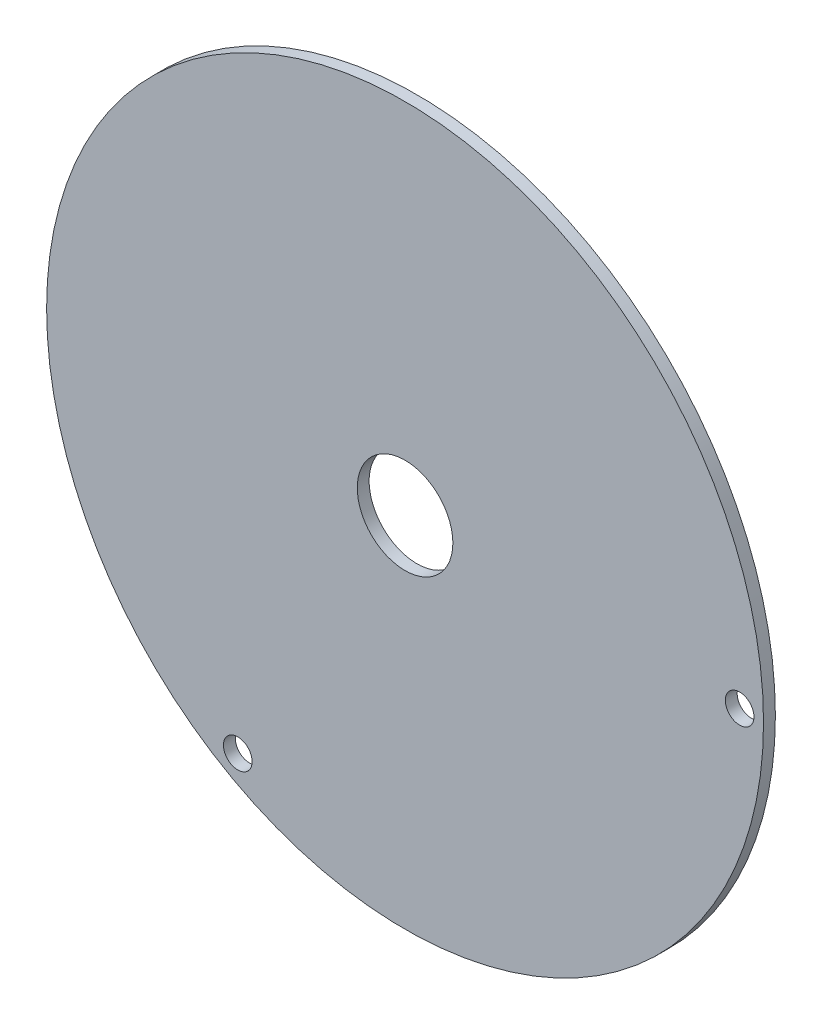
ISO-10303-21;
HEADER;
FILE_DESCRIPTION(('STEP AP214'),'2;1');
FILE_NAME('part.step','',(''),(''),'','','');
FILE_SCHEMA(('AUTOMOTIVE_DESIGN { 1 0 10303 214 1 1 1 1 }'));
ENDSEC;
DATA;
#1=APPLICATION_CONTEXT('core data for automotive mechanical design processes');
#2=APPLICATION_PROTOCOL_DEFINITION('international standard','automotive_design',2000,#1);
#3=PRODUCT_CONTEXT('',#1,'mechanical');
#4=PRODUCT('Part','Part','',(#3));
#5=PRODUCT_RELATED_PRODUCT_CATEGORY('part','',(#4));
#6=PRODUCT_DEFINITION_FORMATION('','',#4);
#7=PRODUCT_DEFINITION_CONTEXT('part definition',#1,'design');
#8=PRODUCT_DEFINITION('design','',#6,#7);
#9=PRODUCT_DEFINITION_SHAPE('','',#8);
#10=(LENGTH_UNIT() NAMED_UNIT(*) SI_UNIT(.MILLI.,.METRE.));
#11=(NAMED_UNIT(*) PLANE_ANGLE_UNIT() SI_UNIT($,.RADIAN.));
#12=(NAMED_UNIT(*) SI_UNIT($,.STERADIAN.) SOLID_ANGLE_UNIT());
#13=UNCERTAINTY_MEASURE_WITH_UNIT(LENGTH_MEASURE(1.E-05),#10,'distance_accuracy_value','');
#14=(GEOMETRIC_REPRESENTATION_CONTEXT(3) GLOBAL_UNCERTAINTY_ASSIGNED_CONTEXT((#13)) GLOBAL_UNIT_ASSIGNED_CONTEXT((#10,
#11,#12)) REPRESENTATION_CONTEXT('',''));
#15=CARTESIAN_POINT('',(0.,0.,0.));
#16=DIRECTION('',(0.,0.,1.));
#17=DIRECTION('',(1.,0.,0.));
#18=AXIS2_PLACEMENT_3D('',#15,#16,#17);
#19=CARTESIAN_POINT('',(0.,0.,1.57480000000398));
#20=DIRECTION('',(0.,0.,-1.));
#21=DIRECTION('',(-0.999999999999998,0.,0.));
#22=AXIS2_PLACEMENT_3D('',#19,#20,#21);
#23=CYLINDRICAL_SURFACE('',#22,47.625);
#24=CARTESIAN_POINT('',(0.,0.,1.57480000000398));
#25=DIRECTION('',(0.,0.,1.));
#26=DIRECTION('',(0.999999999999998,0.,0.));
#27=AXIS2_PLACEMENT_3D('',#24,#25,#26);
#28=CIRCLE('',#27,47.625);
#29=CARTESIAN_POINT('',(47.6249999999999,-1.20445320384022E-13,1.57480000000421));
#30=VERTEX_POINT('',#29);
#31=EDGE_CURVE('E10',#30,#30,#28,.T.);
#32=ORIENTED_EDGE('',*,*,#31,.F.);
#33=EDGE_LOOP('',(#32));
#34=FACE_BOUND('',#33,.T.);
#35=CARTESIAN_POINT('',(0.,0.,0.));
#36=DIRECTION('',(0.,0.,1.));
#37=DIRECTION('',(0.999999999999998,0.,0.));
#38=AXIS2_PLACEMENT_3D('',#35,#36,#37);
#39=CIRCLE('',#38,47.625);
#40=CARTESIAN_POINT('',(47.6249999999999,0.,2.214114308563E-13));
#41=VERTEX_POINT('',#40);
#42=EDGE_CURVE('E36',#41,#41,#39,.T.);
#43=ORIENTED_EDGE('',*,*,#42,.T.);
#44=EDGE_LOOP('',(#43));
#45=FACE_BOUND('',#44,.T.);
#46=ADVANCED_FACE('F30',(#34,#45),#23,.T.);
#47=CARTESIAN_POINT('',(0.,0.,1.57480000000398));
#48=DIRECTION('',(0.,0.,1.));
#49=DIRECTION('',(0.999999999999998,0.,0.));
#50=AXIS2_PLACEMENT_3D('',#47,#48,#49);
#51=PLANE('',#50);
#52=CARTESIAN_POINT('',(-22.2250000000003,-38.4948291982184,1.57479999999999));
#53=DIRECTION('',(0.,0.,1.));
#54=DIRECTION('',(0.999999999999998,0.,0.));
#55=AXIS2_PLACEMENT_3D('',#52,#53,#54);
#56=CIRCLE('',#55,1.905);
#57=CARTESIAN_POINT('',(-20.3200000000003,-38.4948291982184,1.5748));
#58=VERTEX_POINT('',#57);
#59=EDGE_CURVE('E58',#58,#58,#56,.T.);
#60=ORIENTED_EDGE('',*,*,#59,.F.);
#61=EDGE_LOOP('',(#60));
#62=FACE_BOUND('',#61,.T.);
#63=CARTESIAN_POINT('',(0.,0.,1.57480000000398));
#64=DIRECTION('',(0.,0.,1.));
#65=DIRECTION('',(0.999999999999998,0.,0.));
#66=AXIS2_PLACEMENT_3D('',#63,#64,#65);
#67=CIRCLE('',#66,6.35);
#68=CARTESIAN_POINT('',(6.34999999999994,0.,1.57480000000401));
#69=VERTEX_POINT('',#68);
#70=EDGE_CURVE('E52',#69,#69,#67,.T.);
#71=ORIENTED_EDGE('',*,*,#70,.F.);
#72=EDGE_LOOP('',(#71));
#73=FACE_BOUND('',#72,.T.);
#74=CARTESIAN_POINT('',(44.45,0.,1.57480000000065));
#75=DIRECTION('',(0.,0.,1.));
#76=DIRECTION('',(0.999999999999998,0.,0.));
#77=AXIS2_PLACEMENT_3D('',#74,#75,#76);
#78=CIRCLE('',#77,1.905);
#79=CARTESIAN_POINT('',(46.355,0.,1.57480000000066));
#80=VERTEX_POINT('',#79);
#81=EDGE_CURVE('E44',#80,#80,#78,.T.);
#82=ORIENTED_EDGE('',*,*,#81,.F.);
#83=EDGE_LOOP('',(#82));
#84=FACE_BOUND('',#83,.T.);
#85=ORIENTED_EDGE('',*,*,#31,.T.);
#86=EDGE_LOOP('',(#85));
#87=FACE_BOUND('',#86,.T.);
#88=ADVANCED_FACE('F64',(#62,#73,#84,#87),#51,.T.);
#89=CARTESIAN_POINT('',(0.,0.,0.));
#90=DIRECTION('',(0.,0.,1.));
#91=DIRECTION('',(0.999999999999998,0.,0.));
#92=AXIS2_PLACEMENT_3D('',#89,#90,#91);
#93=PLANE('',#92);
#94=CARTESIAN_POINT('',(-22.2250000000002,-38.4948291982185,0.));
#95=DIRECTION('',(0.,0.,1.));
#96=DIRECTION('',(0.999999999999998,0.,0.));
#97=AXIS2_PLACEMENT_3D('',#94,#95,#96);
#98=CIRCLE('',#97,1.905);
#99=CARTESIAN_POINT('',(-20.3200000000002,-38.4948291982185,0.));
#100=VERTEX_POINT('',#99);
#101=EDGE_CURVE('E55',#100,#100,#98,.T.);
#102=ORIENTED_EDGE('',*,*,#101,.T.);
#103=EDGE_LOOP('',(#102));
#104=FACE_BOUND('',#103,.T.);
#105=CARTESIAN_POINT('',(0.,0.,0.));
#106=DIRECTION('',(0.,0.,1.));
#107=DIRECTION('',(0.999999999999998,0.,0.));
#108=AXIS2_PLACEMENT_3D('',#105,#106,#107);
#109=CIRCLE('',#108,6.35);
#110=CARTESIAN_POINT('',(6.34999999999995,0.,0.));
#111=VERTEX_POINT('',#110);
#112=EDGE_CURVE('E49',#111,#111,#109,.T.);
#113=ORIENTED_EDGE('',*,*,#112,.T.);
#114=EDGE_LOOP('',(#113));
#115=FACE_BOUND('',#114,.T.);
#116=CARTESIAN_POINT('',(44.45,-1.6306400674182E-13,4.88498130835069E-12));
#117=DIRECTION('',(0.,0.,1.));
#118=DIRECTION('',(0.999999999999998,0.,0.));
#119=AXIS2_PLACEMENT_3D('',#116,#117,#118);
#120=CIRCLE('',#119,1.905);
#121=CARTESIAN_POINT('',(46.355,-1.6496748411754E-13,4.89383776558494E-12));
#122=VERTEX_POINT('',#121);
#123=EDGE_CURVE('E40',#122,#122,#120,.T.);
#124=ORIENTED_EDGE('',*,*,#123,.T.);
#125=EDGE_LOOP('',(#124));
#126=FACE_BOUND('',#125,.T.);
#127=ORIENTED_EDGE('',*,*,#42,.F.);
#128=EDGE_LOOP('',(#127));
#129=FACE_BOUND('',#128,.T.);
#130=ADVANCED_FACE('F67',(#104,#115,#126,#129),#93,.F.);
#131=CARTESIAN_POINT('',(44.45,-1.6306400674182E-13,4.88498130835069E-12));
#132=DIRECTION('',(0.,0.,1.));
#133=DIRECTION('',(0.999999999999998,0.,0.));
#134=AXIS2_PLACEMENT_3D('',#131,#132,#133);
#135=CYLINDRICAL_SURFACE('',#134,1.905);
#136=ORIENTED_EDGE('',*,*,#123,.F.);
#137=EDGE_LOOP('',(#136));
#138=FACE_BOUND('',#137,.T.);
#139=ORIENTED_EDGE('',*,*,#81,.T.);
#140=EDGE_LOOP('',(#139));
#141=FACE_BOUND('',#140,.T.);
#142=ADVANCED_FACE('F72',(#138,#141),#135,.F.);
#143=CARTESIAN_POINT('',(0.,0.,0.));
#144=DIRECTION('',(0.,0.,1.));
#145=DIRECTION('',(0.999999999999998,0.,0.));
#146=AXIS2_PLACEMENT_3D('',#143,#144,#145);
#147=CYLINDRICAL_SURFACE('',#146,6.35);
#148=ORIENTED_EDGE('',*,*,#112,.F.);
#149=EDGE_LOOP('',(#148));
#150=FACE_BOUND('',#149,.T.);
#151=ORIENTED_EDGE('',*,*,#70,.T.);
#152=EDGE_LOOP('',(#151));
#153=FACE_BOUND('',#152,.T.);
#154=ADVANCED_FACE('F74',(#150,#153),#147,.F.);
#155=CARTESIAN_POINT('',(-22.2250000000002,-38.4948291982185,0.));
#156=DIRECTION('',(0.,0.,1.));
#157=DIRECTION('',(0.999999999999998,0.,0.));
#158=AXIS2_PLACEMENT_3D('',#155,#156,#157);
#159=CYLINDRICAL_SURFACE('',#158,1.905);
#160=ORIENTED_EDGE('',*,*,#101,.F.);
#161=EDGE_LOOP('',(#160));
#162=FACE_BOUND('',#161,.T.);
#163=ORIENTED_EDGE('',*,*,#59,.T.);
#164=EDGE_LOOP('',(#163));
#165=FACE_BOUND('',#164,.T.);
#166=ADVANCED_FACE('F62',(#162,#165),#159,.F.);
#167=CLOSED_SHELL('',(#46,#88,#130,#142,#154,#166));
#168=MANIFOLD_SOLID_BREP('B2',#167);
#169=ADVANCED_BREP_SHAPE_REPRESENTATION('',(#18,#168),#14);
#170=SHAPE_DEFINITION_REPRESENTATION(#9,#169);
ENDSEC;
END-ISO-10303-21;
